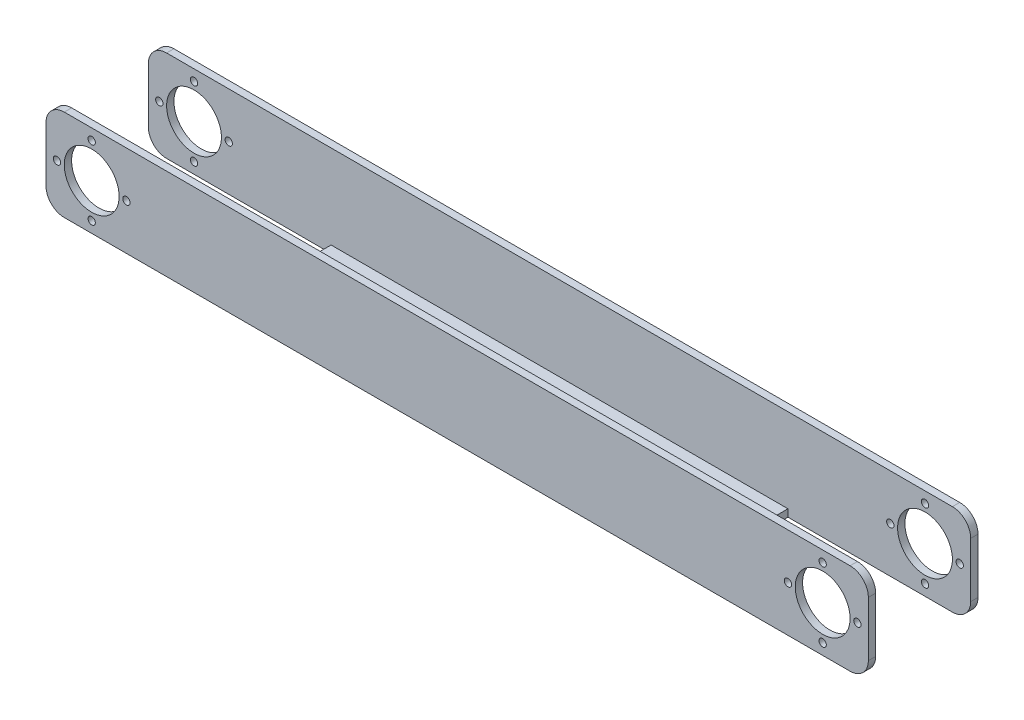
ISO-10303-21;
HEADER;
FILE_DESCRIPTION(('STEP AP214'),'2;1');
FILE_NAME('part.step','',(''),(''),'','','');
FILE_SCHEMA(('AUTOMOTIVE_DESIGN { 1 0 10303 214 1 1 1 1 }'));
ENDSEC;
DATA;
#1=APPLICATION_CONTEXT('core data for automotive mechanical design processes');
#2=APPLICATION_PROTOCOL_DEFINITION('international standard','automotive_design',2000,#1);
#3=PRODUCT_CONTEXT('',#1,'mechanical');
#4=PRODUCT('Part','Part','',(#3));
#5=PRODUCT_RELATED_PRODUCT_CATEGORY('part','',(#4));
#6=PRODUCT_DEFINITION_FORMATION('','',#4);
#7=PRODUCT_DEFINITION_CONTEXT('part definition',#1,'design');
#8=PRODUCT_DEFINITION('design','',#6,#7);
#9=PRODUCT_DEFINITION_SHAPE('','',#8);
#10=(LENGTH_UNIT() NAMED_UNIT(*) SI_UNIT(.MILLI.,.METRE.));
#11=(NAMED_UNIT(*) PLANE_ANGLE_UNIT() SI_UNIT($,.RADIAN.));
#12=(NAMED_UNIT(*) SI_UNIT($,.STERADIAN.) SOLID_ANGLE_UNIT());
#13=UNCERTAINTY_MEASURE_WITH_UNIT(LENGTH_MEASURE(1.E-05),#10,'distance_accuracy_value','');
#14=(GEOMETRIC_REPRESENTATION_CONTEXT(3) GLOBAL_UNCERTAINTY_ASSIGNED_CONTEXT((#13)) GLOBAL_UNIT_ASSIGNED_CONTEXT((#10,
#11,#12)) REPRESENTATION_CONTEXT('',''));
#15=CARTESIAN_POINT('',(0.,0.,0.));
#16=DIRECTION('',(0.,0.,1.));
#17=DIRECTION('',(1.,0.,0.));
#18=AXIS2_PLACEMENT_3D('',#15,#16,#17);
#19=CARTESIAN_POINT('',(112.5,12.5,30.));
#20=DIRECTION('',(-1.,0.,0.));
#21=DIRECTION('',(0.,0.,1.));
#22=AXIS2_PLACEMENT_3D('',#19,#20,#21);
#23=PLANE('',#22);
#24=DIRECTION('',(0.,1.,0.));
#25=VECTOR('',#24,1.);
#26=CARTESIAN_POINT('',(112.5,12.5,30.));
#27=LINE('',#26,#25);
#28=CARTESIAN_POINT('',(112.5,-7.5,30.));
#29=VERTEX_POINT('',#28);
#30=CARTESIAN_POINT('',(112.5,7.5,30.));
#31=VERTEX_POINT('',#30);
#32=EDGE_CURVE('E275',#29,#31,#27,.T.);
#33=ORIENTED_EDGE('',*,*,#32,.F.);
#34=DIRECTION('',(0.,0.,-1.));
#35=VECTOR('',#34,1.);
#36=CARTESIAN_POINT('',(112.5,-7.5,30.));
#37=LINE('',#36,#35);
#38=CARTESIAN_POINT('',(112.5,-7.5,28.));
#39=VERTEX_POINT('',#38);
#40=EDGE_CURVE('E11',#29,#39,#37,.T.);
#41=ORIENTED_EDGE('',*,*,#40,.T.);
#42=DIRECTION('',(0.,1.,0.));
#43=VECTOR('',#42,1.);
#44=CARTESIAN_POINT('',(112.5,12.5,28.));
#45=LINE('',#44,#43);
#46=CARTESIAN_POINT('',(112.5,7.5,28.));
#47=VERTEX_POINT('',#46);
#48=EDGE_CURVE('E249',#39,#47,#45,.T.);
#49=ORIENTED_EDGE('',*,*,#48,.T.);
#50=DIRECTION('',(0.,0.,-1.));
#51=VECTOR('',#50,1.);
#52=CARTESIAN_POINT('',(112.5,7.5,30.));
#53=LINE('',#52,#51);
#54=EDGE_CURVE('E52',#47,#31,#53,.F.);
#55=ORIENTED_EDGE('',*,*,#54,.T.);
#56=EDGE_LOOP('',(#33,#41,#49,#55));
#57=FACE_BOUND('',#56,.T.);
#58=ADVANCED_FACE('F43',(#57),#23,.F.);
#59=CARTESIAN_POINT('',(-112.5,-12.5,30.));
#60=DIRECTION('',(1.,0.,0.));
#61=DIRECTION('',(0.,0.,-1.));
#62=AXIS2_PLACEMENT_3D('',#59,#60,#61);
#63=PLANE('',#62);
#64=DIRECTION('',(0.,-1.,0.));
#65=VECTOR('',#64,1.);
#66=CARTESIAN_POINT('',(-112.5,-12.5,0.));
#67=LINE('',#66,#65);
#68=CARTESIAN_POINT('',(-112.5,7.5,0.));
#69=VERTEX_POINT('',#68);
#70=CARTESIAN_POINT('',(-112.5,-7.5,0.));
#71=VERTEX_POINT('',#70);
#72=EDGE_CURVE('E298',#69,#71,#67,.T.);
#73=ORIENTED_EDGE('',*,*,#72,.T.);
#74=DIRECTION('',(0.,0.,-1.));
#75=VECTOR('',#74,1.);
#76=CARTESIAN_POINT('',(-112.5,-7.5,30.));
#77=LINE('',#76,#75);
#78=CARTESIAN_POINT('',(-112.5,-7.5,2.));
#79=VERTEX_POINT('',#78);
#80=EDGE_CURVE('E382',#71,#79,#77,.F.);
#81=ORIENTED_EDGE('',*,*,#80,.T.);
#82=DIRECTION('',(0.,-1.,0.));
#83=VECTOR('',#82,1.);
#84=CARTESIAN_POINT('',(-112.5,-12.5,2.));
#85=LINE('',#84,#83);
#86=CARTESIAN_POINT('',(-112.5,7.5,2.));
#87=VERTEX_POINT('',#86);
#88=EDGE_CURVE('E250',#87,#79,#85,.T.);
#89=ORIENTED_EDGE('',*,*,#88,.F.);
#90=DIRECTION('',(0.,0.,-1.));
#91=VECTOR('',#90,1.);
#92=CARTESIAN_POINT('',(-112.5,7.5,30.));
#93=LINE('',#92,#91);
#94=EDGE_CURVE('E378',#87,#69,#93,.T.);
#95=ORIENTED_EDGE('',*,*,#94,.T.);
#96=EDGE_LOOP('',(#73,#81,#89,#95));
#97=FACE_BOUND('',#96,.T.);
#98=ADVANCED_FACE('F510',(#97),#63,.F.);
#99=DIRECTION('',(0.,1.,0.));
#100=VECTOR('',#99,1.);
#101=CARTESIAN_POINT('',(112.5,12.5,2.));
#102=LINE('',#101,#100);
#103=CARTESIAN_POINT('',(112.5,-7.5,2.));
#104=VERTEX_POINT('',#103);
#105=CARTESIAN_POINT('',(112.5,7.5,2.));
#106=VERTEX_POINT('',#105);
#107=EDGE_CURVE('E245',#104,#106,#102,.T.);
#108=ORIENTED_EDGE('',*,*,#107,.F.);
#109=DIRECTION('',(0.,0.,-1.));
#110=VECTOR('',#109,1.);
#111=CARTESIAN_POINT('',(112.5,-7.5,30.));
#112=LINE('',#111,#110);
#113=CARTESIAN_POINT('',(112.5,-7.5,0.));
#114=VERTEX_POINT('',#113);
#115=EDGE_CURVE('E442',#104,#114,#112,.T.);
#116=ORIENTED_EDGE('',*,*,#115,.T.);
#117=DIRECTION('',(0.,1.,0.));
#118=VECTOR('',#117,1.);
#119=CARTESIAN_POINT('',(112.5,12.5,0.));
#120=LINE('',#119,#118);
#121=CARTESIAN_POINT('',(112.5,7.5,0.));
#122=VERTEX_POINT('',#121);
#123=EDGE_CURVE('E255',#114,#122,#120,.T.);
#124=ORIENTED_EDGE('',*,*,#123,.T.);
#125=DIRECTION('',(0.,0.,-1.));
#126=VECTOR('',#125,1.);
#127=CARTESIAN_POINT('',(112.5,7.5,30.));
#128=LINE('',#127,#126);
#129=EDGE_CURVE('E439',#122,#106,#128,.F.);
#130=ORIENTED_EDGE('',*,*,#129,.T.);
#131=EDGE_LOOP('',(#108,#116,#124,#130));
#132=FACE_BOUND('',#131,.T.);
#133=ADVANCED_FACE('F493',(#132),#23,.F.);
#134=CARTESIAN_POINT('',(-112.5,12.5,30.));
#135=DIRECTION('',(0.,-1.,0.));
#136=DIRECTION('',(0.,0.,-1.));
#137=AXIS2_PLACEMENT_3D('',#134,#135,#136);
#138=PLANE('',#137);
#139=DIRECTION('',(-1.,0.,0.));
#140=VECTOR('',#139,1.);
#141=CARTESIAN_POINT('',(-112.5,12.5,0.));
#142=LINE('',#141,#140);
#143=CARTESIAN_POINT('',(107.5,12.5,0.));
#144=VERTEX_POINT('',#143);
#145=CARTESIAN_POINT('',(-107.5,12.5,0.));
#146=VERTEX_POINT('',#145);
#147=EDGE_CURVE('E294',#144,#146,#142,.T.);
#148=ORIENTED_EDGE('',*,*,#147,.T.);
#149=DIRECTION('',(0.,0.,-1.));
#150=VECTOR('',#149,1.);
#151=CARTESIAN_POINT('',(-107.5,12.5,30.));
#152=LINE('',#151,#150);
#153=CARTESIAN_POINT('',(-107.5,12.5,2.));
#154=VERTEX_POINT('',#153);
#155=EDGE_CURVE('E400',#146,#154,#152,.F.);
#156=ORIENTED_EDGE('',*,*,#155,.T.);
#157=DIRECTION('',(-1.,0.,0.));
#158=VECTOR('',#157,1.);
#159=CARTESIAN_POINT('',(-112.5,12.5,2.));
#160=LINE('',#159,#158);
#161=CARTESIAN_POINT('',(107.5,12.5,2.));
#162=VERTEX_POINT('',#161);
#163=EDGE_CURVE('E260',#162,#154,#160,.T.);
#164=ORIENTED_EDGE('',*,*,#163,.F.);
#165=DIRECTION('',(0.,0.,-1.));
#166=VECTOR('',#165,1.);
#167=CARTESIAN_POINT('',(107.5,12.5,30.));
#168=LINE('',#167,#166);
#169=EDGE_CURVE('E396',#162,#144,#168,.T.);
#170=ORIENTED_EDGE('',*,*,#169,.T.);
#171=EDGE_LOOP('',(#148,#156,#164,#170));
#172=FACE_BOUND('',#171,.T.);
#173=ADVANCED_FACE('F502',(#172),#138,.F.);
#174=DIRECTION('',(0.,-1.,0.));
#175=VECTOR('',#174,1.);
#176=CARTESIAN_POINT('',(-112.5,-12.5,28.));
#177=LINE('',#176,#175);
#178=CARTESIAN_POINT('',(-112.5,7.5,28.));
#179=VERTEX_POINT('',#178);
#180=CARTESIAN_POINT('',(-112.5,-7.5,28.));
#181=VERTEX_POINT('',#180);
#182=EDGE_CURVE('E256',#179,#181,#177,.T.);
#183=ORIENTED_EDGE('',*,*,#182,.T.);
#184=DIRECTION('',(0.,0.,-1.));
#185=VECTOR('',#184,1.);
#186=CARTESIAN_POINT('',(-112.5,-7.5,30.));
#187=LINE('',#186,#185);
#188=CARTESIAN_POINT('',(-112.5,-7.5,30.));
#189=VERTEX_POINT('',#188);
#190=EDGE_CURVE('E419',#181,#189,#187,.F.);
#191=ORIENTED_EDGE('',*,*,#190,.T.);
#192=DIRECTION('',(0.,-1.,0.));
#193=VECTOR('',#192,1.);
#194=CARTESIAN_POINT('',(-112.5,-12.5,30.));
#195=LINE('',#194,#193);
#196=CARTESIAN_POINT('',(-112.5,7.5,30.));
#197=VERTEX_POINT('',#196);
#198=EDGE_CURVE('E282',#197,#189,#195,.T.);
#199=ORIENTED_EDGE('',*,*,#198,.F.);
#200=DIRECTION('',(0.,0.,-1.));
#201=VECTOR('',#200,1.);
#202=CARTESIAN_POINT('',(-112.5,7.5,30.));
#203=LINE('',#202,#201);
#204=EDGE_CURVE('E415',#197,#179,#203,.T.);
#205=ORIENTED_EDGE('',*,*,#204,.T.);
#206=EDGE_LOOP('',(#183,#191,#199,#205));
#207=FACE_BOUND('',#206,.T.);
#208=ADVANCED_FACE('F467',(#207),#63,.F.);
#209=DIRECTION('',(-1.,0.,0.));
#210=VECTOR('',#209,1.);
#211=CARTESIAN_POINT('',(-112.5,12.5,28.));
#212=LINE('',#211,#210);
#213=CARTESIAN_POINT('',(107.5,12.5,28.));
#214=VERTEX_POINT('',#213);
#215=CARTESIAN_POINT('',(-107.5,12.5,28.));
#216=VERTEX_POINT('',#215);
#217=EDGE_CURVE('E269',#214,#216,#212,.T.);
#218=ORIENTED_EDGE('',*,*,#217,.T.);
#219=DIRECTION('',(0.,0.,-1.));
#220=VECTOR('',#219,1.);
#221=CARTESIAN_POINT('',(-107.5,12.5,30.));
#222=LINE('',#221,#220);
#223=CARTESIAN_POINT('',(-107.5,12.5,30.));
#224=VERTEX_POINT('',#223);
#225=EDGE_CURVE('E59',#216,#224,#222,.F.);
#226=ORIENTED_EDGE('',*,*,#225,.T.);
#227=DIRECTION('',(-1.,0.,0.));
#228=VECTOR('',#227,1.);
#229=CARTESIAN_POINT('',(-112.5,12.5,30.));
#230=LINE('',#229,#228);
#231=CARTESIAN_POINT('',(107.5,12.5,30.));
#232=VERTEX_POINT('',#231);
#233=EDGE_CURVE('E278',#232,#224,#230,.T.);
#234=ORIENTED_EDGE('',*,*,#233,.F.);
#235=DIRECTION('',(0.,0.,-1.));
#236=VECTOR('',#235,1.);
#237=CARTESIAN_POINT('',(107.5,12.5,30.));
#238=LINE('',#237,#236);
#239=EDGE_CURVE('E433',#232,#214,#238,.T.);
#240=ORIENTED_EDGE('',*,*,#239,.T.);
#241=EDGE_LOOP('',(#218,#226,#234,#240));
#242=FACE_BOUND('',#241,.T.);
#243=ADVANCED_FACE('F457',(#242),#138,.F.);
#244=CARTESIAN_POINT('',(-112.5,-12.5,30.));
#245=DIRECTION('',(0.,1.,0.));
#246=DIRECTION('',(0.,0.,1.));
#247=AXIS2_PLACEMENT_3D('',#244,#245,#246);
#248=PLANE('',#247);
#249=DIRECTION('',(1.,0.,0.));
#250=VECTOR('',#249,1.);
#251=CARTESIAN_POINT('',(-112.5,-12.5,2.));
#252=LINE('',#251,#250);
#253=CARTESIAN_POINT('',(-107.5,-12.5,2.));
#254=VERTEX_POINT('',#253);
#255=CARTESIAN_POINT('',(-62.5,-12.5,2.));
#256=VERTEX_POINT('',#255);
#257=EDGE_CURVE('E183',#254,#256,#252,.T.);
#258=ORIENTED_EDGE('',*,*,#257,.F.);
#259=DIRECTION('',(0.,0.,-1.));
#260=VECTOR('',#259,1.);
#261=CARTESIAN_POINT('',(-107.5,-12.5,30.));
#262=LINE('',#261,#260);
#263=CARTESIAN_POINT('',(-107.5,-12.5,0.));
#264=VERTEX_POINT('',#263);
#265=EDGE_CURVE('E363',#254,#264,#262,.T.);
#266=ORIENTED_EDGE('',*,*,#265,.T.);
#267=DIRECTION('',(1.,0.,0.));
#268=VECTOR('',#267,1.);
#269=CARTESIAN_POINT('',(-112.5,-12.5,0.));
#270=LINE('',#269,#268);
#271=CARTESIAN_POINT('',(107.5,-12.5,0.));
#272=VERTEX_POINT('',#271);
#273=EDGE_CURVE('E279',#264,#272,#270,.T.);
#274=ORIENTED_EDGE('',*,*,#273,.T.);
#275=DIRECTION('',(0.,0.,-1.));
#276=VECTOR('',#275,1.);
#277=CARTESIAN_POINT('',(107.5,-12.5,30.));
#278=LINE('',#277,#276);
#279=CARTESIAN_POINT('',(107.5,-12.5,2.));
#280=VERTEX_POINT('',#279);
#281=EDGE_CURVE('E357',#272,#280,#278,.F.);
#282=ORIENTED_EDGE('',*,*,#281,.T.);
#283=DIRECTION('',(1.,0.,0.));
#284=VECTOR('',#283,1.);
#285=CARTESIAN_POINT('',(112.5,-12.5,2.));
#286=LINE('',#285,#284);
#287=CARTESIAN_POINT('',(62.5,-12.5,1.99999999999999));
#288=VERTEX_POINT('',#287);
#289=EDGE_CURVE('E231',#288,#280,#286,.T.);
#290=ORIENTED_EDGE('',*,*,#289,.F.);
#291=DIRECTION('',(0.,0.,-1.));
#292=VECTOR('',#291,1.);
#293=CARTESIAN_POINT('',(62.5,-12.5,28.));
#294=LINE('',#293,#292);
#295=CARTESIAN_POINT('',(62.5,-12.5,28.));
#296=VERTEX_POINT('',#295);
#297=EDGE_CURVE('E226',#296,#288,#294,.T.);
#298=ORIENTED_EDGE('',*,*,#297,.F.);
#299=DIRECTION('',(-1.,0.,0.));
#300=VECTOR('',#299,1.);
#301=CARTESIAN_POINT('',(112.5,-12.5,28.));
#302=LINE('',#301,#300);
#303=CARTESIAN_POINT('',(107.5,-12.5,28.));
#304=VERTEX_POINT('',#303);
#305=EDGE_CURVE('E223',#304,#296,#302,.T.);
#306=ORIENTED_EDGE('',*,*,#305,.F.);
#307=DIRECTION('',(0.,0.,-1.));
#308=VECTOR('',#307,1.);
#309=CARTESIAN_POINT('',(107.5,-12.5,30.));
#310=LINE('',#309,#308);
#311=CARTESIAN_POINT('',(107.5,-12.5,30.));
#312=VERTEX_POINT('',#311);
#313=EDGE_CURVE('E290',#304,#312,#310,.F.);
#314=ORIENTED_EDGE('',*,*,#313,.T.);
#315=DIRECTION('',(1.,0.,0.));
#316=VECTOR('',#315,1.);
#317=CARTESIAN_POINT('',(-112.5,-12.5,30.));
#318=LINE('',#317,#316);
#319=CARTESIAN_POINT('',(-107.5,-12.5,30.));
#320=VERTEX_POINT('',#319);
#321=EDGE_CURVE('E286',#320,#312,#318,.T.);
#322=ORIENTED_EDGE('',*,*,#321,.F.);
#323=DIRECTION('',(0.,0.,-1.));
#324=VECTOR('',#323,1.);
#325=CARTESIAN_POINT('',(-107.5,-12.5,30.));
#326=LINE('',#325,#324);
#327=CARTESIAN_POINT('',(-107.5,-12.5,28.));
#328=VERTEX_POINT('',#327);
#329=EDGE_CURVE('E360',#320,#328,#326,.T.);
#330=ORIENTED_EDGE('',*,*,#329,.T.);
#331=DIRECTION('',(-1.,0.,0.));
#332=VECTOR('',#331,1.);
#333=CARTESIAN_POINT('',(-112.5,-12.5,28.));
#334=LINE('',#333,#332);
#335=CARTESIAN_POINT('',(-62.5,-12.5,28.));
#336=VERTEX_POINT('',#335);
#337=EDGE_CURVE('E208',#336,#328,#334,.T.);
#338=ORIENTED_EDGE('',*,*,#337,.F.);
#339=DIRECTION('',(0.,0.,1.));
#340=VECTOR('',#339,1.);
#341=CARTESIAN_POINT('',(-62.5,-12.5,2.));
#342=LINE('',#341,#340);
#343=EDGE_CURVE('E197',#256,#336,#342,.T.);
#344=ORIENTED_EDGE('',*,*,#343,.F.);
#345=EDGE_LOOP('',(#258,#266,#274,#282,#290,#298,#306,#314,#322,#330,#338,#344));
#346=FACE_BOUND('',#345,.T.);
#347=ADVANCED_FACE('F210',(#346),#248,.F.);
#348=CARTESIAN_POINT('',(0.,0.,30.));
#349=DIRECTION('',(0.,0.,1.));
#350=DIRECTION('',(1.,0.,0.));
#351=AXIS2_PLACEMENT_3D('',#348,#349,#350);
#352=PLANE('',#351);
#353=CARTESIAN_POINT('',(100.,-9.5,30.));
#354=DIRECTION('',(0.,0.,1.));
#355=DIRECTION('',(1.,0.,0.));
#356=AXIS2_PLACEMENT_3D('',#353,#354,#355);
#357=CIRCLE('',#356,0.999999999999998);
#358=CARTESIAN_POINT('',(101.,-9.5,30.));
#359=VERTEX_POINT('',#358);
#360=EDGE_CURVE('E1070',#359,#359,#357,.T.);
#361=ORIENTED_EDGE('',*,*,#360,.F.);
#362=EDGE_LOOP('',(#361));
#363=FACE_BOUND('',#362,.T.);
#364=CARTESIAN_POINT('',(109.5,0.,30.));
#365=DIRECTION('',(0.,0.,1.));
#366=DIRECTION('',(1.,0.,0.));
#367=AXIS2_PLACEMENT_3D('',#364,#365,#366);
#368=CIRCLE('',#367,0.999999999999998);
#369=CARTESIAN_POINT('',(110.5,0.,30.));
#370=VERTEX_POINT('',#369);
#371=EDGE_CURVE('E1165',#370,#370,#368,.T.);
#372=ORIENTED_EDGE('',*,*,#371,.F.);
#373=EDGE_LOOP('',(#372));
#374=FACE_BOUND('',#373,.T.);
#375=CARTESIAN_POINT('',(100.,9.5,30.));
#376=DIRECTION('',(0.,0.,1.));
#377=DIRECTION('',(1.,0.,0.));
#378=AXIS2_PLACEMENT_3D('',#375,#376,#377);
#379=CIRCLE('',#378,0.999999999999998);
#380=CARTESIAN_POINT('',(101.,9.5,30.));
#381=VERTEX_POINT('',#380);
#382=EDGE_CURVE('E1145',#381,#381,#379,.T.);
#383=ORIENTED_EDGE('',*,*,#382,.F.);
#384=EDGE_LOOP('',(#383));
#385=FACE_BOUND('',#384,.T.);
#386=CARTESIAN_POINT('',(100.,0.,30.));
#387=DIRECTION('',(0.,0.,1.));
#388=DIRECTION('',(1.,0.,0.));
#389=AXIS2_PLACEMENT_3D('',#386,#387,#388);
#390=CIRCLE('',#389,7.50000000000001);
#391=CARTESIAN_POINT('',(107.5,0.,30.));
#392=VERTEX_POINT('',#391);
#393=EDGE_CURVE('E1154',#392,#392,#390,.T.);
#394=ORIENTED_EDGE('',*,*,#393,.F.);
#395=EDGE_LOOP('',(#394));
#396=FACE_BOUND('',#395,.T.);
#397=CARTESIAN_POINT('',(90.5,0.,30.));
#398=DIRECTION('',(0.,0.,1.));
#399=DIRECTION('',(1.,0.,0.));
#400=AXIS2_PLACEMENT_3D('',#397,#398,#399);
#401=CIRCLE('',#400,0.999999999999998);
#402=CARTESIAN_POINT('',(91.5,0.,30.));
#403=VERTEX_POINT('',#402);
#404=EDGE_CURVE('E1137',#403,#403,#401,.T.);
#405=ORIENTED_EDGE('',*,*,#404,.F.);
#406=EDGE_LOOP('',(#405));
#407=FACE_BOUND('',#406,.T.);
#408=CARTESIAN_POINT('',(-90.5,0.,30.));
#409=DIRECTION('',(0.,0.,1.));
#410=DIRECTION('',(-1.,0.,0.));
#411=AXIS2_PLACEMENT_3D('',#408,#409,#410);
#412=CIRCLE('',#411,0.999999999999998);
#413=CARTESIAN_POINT('',(-91.5,0.,30.));
#414=VERTEX_POINT('',#413);
#415=EDGE_CURVE('E1129',#414,#414,#412,.T.);
#416=ORIENTED_EDGE('',*,*,#415,.F.);
#417=EDGE_LOOP('',(#416));
#418=FACE_BOUND('',#417,.T.);
#419=CARTESIAN_POINT('',(-100.,-9.50000000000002,30.));
#420=DIRECTION('',(0.,0.,1.));
#421=DIRECTION('',(-1.,0.,0.));
#422=AXIS2_PLACEMENT_3D('',#419,#420,#421);
#423=CIRCLE('',#422,0.999999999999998);
#424=CARTESIAN_POINT('',(-101.,-9.50000000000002,30.));
#425=VERTEX_POINT('',#424);
#426=EDGE_CURVE('E1121',#425,#425,#423,.T.);
#427=ORIENTED_EDGE('',*,*,#426,.F.);
#428=EDGE_LOOP('',(#427));
#429=FACE_BOUND('',#428,.T.);
#430=CARTESIAN_POINT('',(-109.5,0.,30.));
#431=DIRECTION('',(0.,0.,1.));
#432=DIRECTION('',(-1.,0.,0.));
#433=AXIS2_PLACEMENT_3D('',#430,#431,#432);
#434=CIRCLE('',#433,0.999999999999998);
#435=CARTESIAN_POINT('',(-110.5,0.,30.));
#436=VERTEX_POINT('',#435);
#437=EDGE_CURVE('E1112',#436,#436,#434,.T.);
#438=ORIENTED_EDGE('',*,*,#437,.F.);
#439=EDGE_LOOP('',(#438));
#440=FACE_BOUND('',#439,.T.);
#441=CARTESIAN_POINT('',(-100.,9.49999999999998,30.));
#442=DIRECTION('',(0.,0.,1.));
#443=DIRECTION('',(-1.,0.,0.));
#444=AXIS2_PLACEMENT_3D('',#441,#442,#443);
#445=CIRCLE('',#444,0.999999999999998);
#446=CARTESIAN_POINT('',(-101.,9.49999999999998,30.));
#447=VERTEX_POINT('',#446);
#448=EDGE_CURVE('E1172',#447,#447,#445,.T.);
#449=ORIENTED_EDGE('',*,*,#448,.F.);
#450=EDGE_LOOP('',(#449));
#451=FACE_BOUND('',#450,.T.);
#452=CARTESIAN_POINT('',(-100.,0.,30.));
#453=DIRECTION('',(0.,0.,1.));
#454=DIRECTION('',(1.,0.,0.));
#455=AXIS2_PLACEMENT_3D('',#452,#453,#454);
#456=CIRCLE('',#455,7.50000000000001);
#457=CARTESIAN_POINT('',(-92.5,0.,30.));
#458=VERTEX_POINT('',#457);
#459=EDGE_CURVE('E1104',#458,#458,#456,.T.);
#460=ORIENTED_EDGE('',*,*,#459,.F.);
#461=EDGE_LOOP('',(#460));
#462=FACE_BOUND('',#461,.T.);
#463=ORIENTED_EDGE('',*,*,#198,.T.);
#464=CARTESIAN_POINT('',(-107.5,-7.5,30.));
#465=DIRECTION('',(0.,0.,1.));
#466=DIRECTION('',(1.,0.,0.));
#467=AXIS2_PLACEMENT_3D('',#464,#465,#466);
#468=CIRCLE('',#467,5.);
#469=EDGE_CURVE('E430',#189,#320,#468,.T.);
#470=ORIENTED_EDGE('',*,*,#469,.T.);
#471=ORIENTED_EDGE('',*,*,#321,.T.);
#472=CARTESIAN_POINT('',(107.5,-7.5,30.));
#473=DIRECTION('',(0.,0.,1.));
#474=DIRECTION('',(1.,0.,0.));
#475=AXIS2_PLACEMENT_3D('',#472,#473,#474);
#476=CIRCLE('',#475,5.);
#477=EDGE_CURVE('E424',#312,#29,#476,.T.);
#478=ORIENTED_EDGE('',*,*,#477,.T.);
#479=ORIENTED_EDGE('',*,*,#32,.T.);
#480=CARTESIAN_POINT('',(107.5,7.5,30.));
#481=DIRECTION('',(0.,0.,1.));
#482=DIRECTION('',(1.,0.,0.));
#483=AXIS2_PLACEMENT_3D('',#480,#481,#482);
#484=CIRCLE('',#483,5.);
#485=EDGE_CURVE('E66',#31,#232,#484,.T.);
#486=ORIENTED_EDGE('',*,*,#485,.T.);
#487=ORIENTED_EDGE('',*,*,#233,.T.);
#488=CARTESIAN_POINT('',(-107.5,7.5,30.));
#489=DIRECTION('',(0.,0.,1.));
#490=DIRECTION('',(1.,0.,0.));
#491=AXIS2_PLACEMENT_3D('',#488,#489,#490);
#492=CIRCLE('',#491,5.);
#493=EDGE_CURVE('E427',#224,#197,#492,.T.);
#494=ORIENTED_EDGE('',*,*,#493,.T.);
#495=EDGE_LOOP('',(#463,#470,#471,#478,#479,#486,#487,#494));
#496=FACE_BOUND('',#495,.T.);
#497=ADVANCED_FACE('F453',(#363,#374,#385,#396,#407,#418,#429,#440,#451,#462,#496),#352,.T.);
#498=CARTESIAN_POINT('',(0.,0.,0.));
#499=DIRECTION('',(0.,0.,1.));
#500=DIRECTION('',(1.,0.,0.));
#501=AXIS2_PLACEMENT_3D('',#498,#499,#500);
#502=PLANE('',#501);
#503=CARTESIAN_POINT('',(100.,-9.5,0.));
#504=DIRECTION('',(0.,0.,1.));
#505=DIRECTION('',(1.,0.,0.));
#506=AXIS2_PLACEMENT_3D('',#503,#504,#505);
#507=CIRCLE('',#506,0.999999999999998);
#508=CARTESIAN_POINT('',(101.,-9.5,0.));
#509=VERTEX_POINT('',#508);
#510=EDGE_CURVE('E1162',#509,#509,#507,.T.);
#511=ORIENTED_EDGE('',*,*,#510,.T.);
#512=EDGE_LOOP('',(#511));
#513=FACE_BOUND('',#512,.T.);
#514=CARTESIAN_POINT('',(109.5,0.,0.));
#515=DIRECTION('',(0.,0.,1.));
#516=DIRECTION('',(1.,0.,0.));
#517=AXIS2_PLACEMENT_3D('',#514,#515,#516);
#518=CIRCLE('',#517,0.999999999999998);
#519=CARTESIAN_POINT('',(110.5,0.,0.));
#520=VERTEX_POINT('',#519);
#521=EDGE_CURVE('E1150',#520,#520,#518,.T.);
#522=ORIENTED_EDGE('',*,*,#521,.T.);
#523=EDGE_LOOP('',(#522));
#524=FACE_BOUND('',#523,.T.);
#525=CARTESIAN_POINT('',(100.,9.5,0.));
#526=DIRECTION('',(0.,0.,1.));
#527=DIRECTION('',(1.,0.,0.));
#528=AXIS2_PLACEMENT_3D('',#525,#526,#527);
#529=CIRCLE('',#528,0.999999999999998);
#530=CARTESIAN_POINT('',(101.,9.5,0.));
#531=VERTEX_POINT('',#530);
#532=EDGE_CURVE('E1149',#531,#531,#529,.T.);
#533=ORIENTED_EDGE('',*,*,#532,.T.);
#534=EDGE_LOOP('',(#533));
#535=FACE_BOUND('',#534,.T.);
#536=CARTESIAN_POINT('',(100.,0.,0.));
#537=DIRECTION('',(0.,0.,1.));
#538=DIRECTION('',(1.,0.,0.));
#539=AXIS2_PLACEMENT_3D('',#536,#537,#538);
#540=CIRCLE('',#539,7.50000000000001);
#541=CARTESIAN_POINT('',(107.5,0.,0.));
#542=VERTEX_POINT('',#541);
#543=EDGE_CURVE('E1108',#542,#542,#540,.T.);
#544=ORIENTED_EDGE('',*,*,#543,.T.);
#545=EDGE_LOOP('',(#544));
#546=FACE_BOUND('',#545,.T.);
#547=CARTESIAN_POINT('',(90.5,0.,0.));
#548=DIRECTION('',(0.,0.,1.));
#549=DIRECTION('',(1.,0.,0.));
#550=AXIS2_PLACEMENT_3D('',#547,#548,#549);
#551=CIRCLE('',#550,0.999999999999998);
#552=CARTESIAN_POINT('',(91.5,0.,0.));
#553=VERTEX_POINT('',#552);
#554=EDGE_CURVE('E1141',#553,#553,#551,.T.);
#555=ORIENTED_EDGE('',*,*,#554,.T.);
#556=EDGE_LOOP('',(#555));
#557=FACE_BOUND('',#556,.T.);
#558=CARTESIAN_POINT('',(-90.5,0.,0.));
#559=DIRECTION('',(0.,0.,1.));
#560=DIRECTION('',(-1.,0.,0.));
#561=AXIS2_PLACEMENT_3D('',#558,#559,#560);
#562=CIRCLE('',#561,0.999999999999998);
#563=CARTESIAN_POINT('',(-91.5,0.,0.));
#564=VERTEX_POINT('',#563);
#565=EDGE_CURVE('E1133',#564,#564,#562,.T.);
#566=ORIENTED_EDGE('',*,*,#565,.T.);
#567=EDGE_LOOP('',(#566));
#568=FACE_BOUND('',#567,.T.);
#569=CARTESIAN_POINT('',(-100.,-9.50000000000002,0.));
#570=DIRECTION('',(0.,0.,1.));
#571=DIRECTION('',(-1.,0.,0.));
#572=AXIS2_PLACEMENT_3D('',#569,#570,#571);
#573=CIRCLE('',#572,0.999999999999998);
#574=CARTESIAN_POINT('',(-101.,-9.50000000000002,0.));
#575=VERTEX_POINT('',#574);
#576=EDGE_CURVE('E1125',#575,#575,#573,.T.);
#577=ORIENTED_EDGE('',*,*,#576,.T.);
#578=EDGE_LOOP('',(#577));
#579=FACE_BOUND('',#578,.T.);
#580=CARTESIAN_POINT('',(-109.5,0.,0.));
#581=DIRECTION('',(0.,0.,1.));
#582=DIRECTION('',(-1.,0.,0.));
#583=AXIS2_PLACEMENT_3D('',#580,#581,#582);
#584=CIRCLE('',#583,0.999999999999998);
#585=CARTESIAN_POINT('',(-110.5,0.,0.));
#586=VERTEX_POINT('',#585);
#587=EDGE_CURVE('E1116',#586,#586,#584,.T.);
#588=ORIENTED_EDGE('',*,*,#587,.T.);
#589=EDGE_LOOP('',(#588));
#590=FACE_BOUND('',#589,.T.);
#591=CARTESIAN_POINT('',(-100.,9.49999999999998,0.));
#592=DIRECTION('',(0.,0.,1.));
#593=DIRECTION('',(-1.,0.,0.));
#594=AXIS2_PLACEMENT_3D('',#591,#592,#593);
#595=CIRCLE('',#594,0.999999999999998);
#596=CARTESIAN_POINT('',(-101.,9.49999999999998,0.));
#597=VERTEX_POINT('',#596);
#598=EDGE_CURVE('E1117',#597,#597,#595,.T.);
#599=ORIENTED_EDGE('',*,*,#598,.T.);
#600=EDGE_LOOP('',(#599));
#601=FACE_BOUND('',#600,.T.);
#602=CARTESIAN_POINT('',(-100.,0.,0.));
#603=DIRECTION('',(0.,0.,1.));
#604=DIRECTION('',(1.,0.,0.));
#605=AXIS2_PLACEMENT_3D('',#602,#603,#604);
#606=CIRCLE('',#605,7.50000000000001);
#607=CARTESIAN_POINT('',(-92.5,0.,0.));
#608=VERTEX_POINT('',#607);
#609=EDGE_CURVE('E310',#608,#608,#606,.T.);
#610=ORIENTED_EDGE('',*,*,#609,.T.);
#611=EDGE_LOOP('',(#610));
#612=FACE_BOUND('',#611,.T.);
#613=ORIENTED_EDGE('',*,*,#273,.F.);
#614=CARTESIAN_POINT('',(-107.5,-7.5,0.));
#615=DIRECTION('',(0.,0.,1.));
#616=DIRECTION('',(1.,0.,0.));
#617=AXIS2_PLACEMENT_3D('',#614,#615,#616);
#618=CIRCLE('',#617,5.);
#619=EDGE_CURVE('E375',#264,#71,#618,.F.);
#620=ORIENTED_EDGE('',*,*,#619,.T.);
#621=ORIENTED_EDGE('',*,*,#72,.F.);
#622=CARTESIAN_POINT('',(-107.5,7.5,0.));
#623=DIRECTION('',(0.,0.,1.));
#624=DIRECTION('',(1.,0.,0.));
#625=AXIS2_PLACEMENT_3D('',#622,#623,#624);
#626=CIRCLE('',#625,5.);
#627=EDGE_CURVE('E372',#69,#146,#626,.F.);
#628=ORIENTED_EDGE('',*,*,#627,.T.);
#629=ORIENTED_EDGE('',*,*,#147,.F.);
#630=CARTESIAN_POINT('',(107.5,7.5,0.));
#631=DIRECTION('',(0.,0.,1.));
#632=DIRECTION('',(1.,0.,0.));
#633=AXIS2_PLACEMENT_3D('',#630,#631,#632);
#634=CIRCLE('',#633,5.);
#635=EDGE_CURVE('E366',#144,#122,#634,.F.);
#636=ORIENTED_EDGE('',*,*,#635,.T.);
#637=ORIENTED_EDGE('',*,*,#123,.F.);
#638=CARTESIAN_POINT('',(107.5,-7.5,0.));
#639=DIRECTION('',(0.,0.,1.));
#640=DIRECTION('',(1.,0.,0.));
#641=AXIS2_PLACEMENT_3D('',#638,#639,#640);
#642=CIRCLE('',#641,5.);
#643=EDGE_CURVE('E369',#114,#272,#642,.F.);
#644=ORIENTED_EDGE('',*,*,#643,.T.);
#645=EDGE_LOOP('',(#613,#620,#621,#628,#629,#636,#637,#644));
#646=FACE_BOUND('',#645,.T.);
#647=ADVANCED_FACE('F516',(#513,#524,#535,#546,#557,#568,#579,#590,#601,#612,#646),#502,.F.);
#648=CARTESIAN_POINT('',(-112.5,-10.5,30.));
#649=DIRECTION('',(0.,1.,0.));
#650=DIRECTION('',(0.,0.,1.));
#651=AXIS2_PLACEMENT_3D('',#648,#649,#650);
#652=PLANE('',#651);
#653=DIRECTION('',(0.,0.,-1.));
#654=VECTOR('',#653,1.);
#655=CARTESIAN_POINT('',(-62.5,-10.5,30.));
#656=LINE('',#655,#654);
#657=CARTESIAN_POINT('',(-62.5,-10.5,28.));
#658=VERTEX_POINT('',#657);
#659=CARTESIAN_POINT('',(-62.5,-10.5,2.));
#660=VERTEX_POINT('',#659);
#661=EDGE_CURVE('E205',#658,#660,#656,.T.);
#662=ORIENTED_EDGE('',*,*,#661,.F.);
#663=DIRECTION('',(1.,0.,0.));
#664=VECTOR('',#663,1.);
#665=CARTESIAN_POINT('',(-112.5,-10.5,28.));
#666=LINE('',#665,#664);
#667=CARTESIAN_POINT('',(62.5,-10.5,28.));
#668=VERTEX_POINT('',#667);
#669=EDGE_CURVE('E251',#658,#668,#666,.T.);
#670=ORIENTED_EDGE('',*,*,#669,.T.);
#671=DIRECTION('',(0.,0.,1.));
#672=VECTOR('',#671,1.);
#673=CARTESIAN_POINT('',(62.5,-10.5,30.));
#674=LINE('',#673,#672);
#675=CARTESIAN_POINT('',(62.5,-10.5,2.));
#676=VERTEX_POINT('',#675);
#677=EDGE_CURVE('E221',#676,#668,#674,.T.);
#678=ORIENTED_EDGE('',*,*,#677,.F.);
#679=DIRECTION('',(1.,0.,0.));
#680=VECTOR('',#679,1.);
#681=CARTESIAN_POINT('',(-112.5,-10.5,2.));
#682=LINE('',#681,#680);
#683=EDGE_CURVE('E246',#660,#676,#682,.T.);
#684=ORIENTED_EDGE('',*,*,#683,.F.);
#685=EDGE_LOOP('',(#662,#670,#678,#684));
#686=FACE_BOUND('',#685,.T.);
#687=ADVANCED_FACE('F477',(#686),#652,.T.);
#688=CARTESIAN_POINT('',(0.,0.,28.));
#689=DIRECTION('',(0.,0.,1.));
#690=DIRECTION('',(1.,0.,0.));
#691=AXIS2_PLACEMENT_3D('',#688,#689,#690);
#692=PLANE('',#691);
#693=CARTESIAN_POINT('',(100.,-9.5,28.));
#694=DIRECTION('',(0.,0.,1.));
#695=DIRECTION('',(1.,0.,0.));
#696=AXIS2_PLACEMENT_3D('',#693,#694,#695);
#697=CIRCLE('',#696,0.999999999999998);
#698=CARTESIAN_POINT('',(101.,-9.5,28.));
#699=VERTEX_POINT('',#698);
#700=EDGE_CURVE('E227',#699,#699,#697,.T.);
#701=ORIENTED_EDGE('',*,*,#700,.T.);
#702=EDGE_LOOP('',(#701));
#703=FACE_BOUND('',#702,.T.);
#704=CARTESIAN_POINT('',(109.5,0.,28.));
#705=DIRECTION('',(0.,0.,1.));
#706=DIRECTION('',(1.,0.,0.));
#707=AXIS2_PLACEMENT_3D('',#704,#705,#706);
#708=CIRCLE('',#707,0.999999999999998);
#709=CARTESIAN_POINT('',(110.5,0.,28.));
#710=VERTEX_POINT('',#709);
#711=EDGE_CURVE('E350',#710,#710,#708,.T.);
#712=ORIENTED_EDGE('',*,*,#711,.T.);
#713=EDGE_LOOP('',(#712));
#714=FACE_BOUND('',#713,.T.);
#715=CARTESIAN_POINT('',(100.,9.5,28.));
#716=DIRECTION('',(0.,0.,1.));
#717=DIRECTION('',(1.,0.,0.));
#718=AXIS2_PLACEMENT_3D('',#715,#716,#717);
#719=CIRCLE('',#718,0.999999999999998);
#720=CARTESIAN_POINT('',(101.,9.5,28.));
#721=VERTEX_POINT('',#720);
#722=EDGE_CURVE('E345',#721,#721,#719,.T.);
#723=ORIENTED_EDGE('',*,*,#722,.T.);
#724=EDGE_LOOP('',(#723));
#725=FACE_BOUND('',#724,.T.);
#726=CARTESIAN_POINT('',(100.,0.,28.));
#727=DIRECTION('',(0.,0.,1.));
#728=DIRECTION('',(1.,0.,0.));
#729=AXIS2_PLACEMENT_3D('',#726,#727,#728);
#730=CIRCLE('',#729,7.50000000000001);
#731=CARTESIAN_POINT('',(107.5,0.,28.));
#732=VERTEX_POINT('',#731);
#733=EDGE_CURVE('E340',#732,#732,#730,.T.);
#734=ORIENTED_EDGE('',*,*,#733,.T.);
#735=EDGE_LOOP('',(#734));
#736=FACE_BOUND('',#735,.T.);
#737=CARTESIAN_POINT('',(90.5,0.,28.));
#738=DIRECTION('',(0.,0.,1.));
#739=DIRECTION('',(1.,0.,0.));
#740=AXIS2_PLACEMENT_3D('',#737,#738,#739);
#741=CIRCLE('',#740,0.999999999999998);
#742=CARTESIAN_POINT('',(91.5,0.,28.));
#743=VERTEX_POINT('',#742);
#744=EDGE_CURVE('E335',#743,#743,#741,.T.);
#745=ORIENTED_EDGE('',*,*,#744,.T.);
#746=EDGE_LOOP('',(#745));
#747=FACE_BOUND('',#746,.T.);
#748=CARTESIAN_POINT('',(-90.5,0.,28.));
#749=DIRECTION('',(0.,0.,1.));
#750=DIRECTION('',(1.,0.,0.));
#751=AXIS2_PLACEMENT_3D('',#748,#749,#750);
#752=CIRCLE('',#751,0.999999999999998);
#753=CARTESIAN_POINT('',(-89.5,0.,28.));
#754=VERTEX_POINT('',#753);
#755=EDGE_CURVE('E330',#754,#754,#752,.T.);
#756=ORIENTED_EDGE('',*,*,#755,.T.);
#757=EDGE_LOOP('',(#756));
#758=FACE_BOUND('',#757,.T.);
#759=CARTESIAN_POINT('',(-100.,-9.50000000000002,28.));
#760=DIRECTION('',(0.,0.,1.));
#761=DIRECTION('',(1.,0.,0.));
#762=AXIS2_PLACEMENT_3D('',#759,#760,#761);
#763=CIRCLE('',#762,0.999999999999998);
#764=CARTESIAN_POINT('',(-99.,-9.50000000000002,28.));
#765=VERTEX_POINT('',#764);
#766=EDGE_CURVE('E325',#765,#765,#763,.T.);
#767=ORIENTED_EDGE('',*,*,#766,.T.);
#768=EDGE_LOOP('',(#767));
#769=FACE_BOUND('',#768,.T.);
#770=CARTESIAN_POINT('',(-109.5,0.,28.));
#771=DIRECTION('',(0.,0.,1.));
#772=DIRECTION('',(1.,0.,0.));
#773=AXIS2_PLACEMENT_3D('',#770,#771,#772);
#774=CIRCLE('',#773,0.999999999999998);
#775=CARTESIAN_POINT('',(-108.5,0.,28.));
#776=VERTEX_POINT('',#775);
#777=EDGE_CURVE('E320',#776,#776,#774,.T.);
#778=ORIENTED_EDGE('',*,*,#777,.T.);
#779=EDGE_LOOP('',(#778));
#780=FACE_BOUND('',#779,.T.);
#781=CARTESIAN_POINT('',(-100.,9.49999999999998,28.));
#782=DIRECTION('',(0.,0.,1.));
#783=DIRECTION('',(1.,0.,0.));
#784=AXIS2_PLACEMENT_3D('',#781,#782,#783);
#785=CIRCLE('',#784,0.999999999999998);
#786=CARTESIAN_POINT('',(-99.,9.49999999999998,28.));
#787=VERTEX_POINT('',#786);
#788=EDGE_CURVE('E315',#787,#787,#785,.T.);
#789=ORIENTED_EDGE('',*,*,#788,.T.);
#790=EDGE_LOOP('',(#789));
#791=FACE_BOUND('',#790,.T.);
#792=CARTESIAN_POINT('',(-100.,0.,28.));
#793=DIRECTION('',(0.,0.,1.));
#794=DIRECTION('',(1.,0.,0.));
#795=AXIS2_PLACEMENT_3D('',#792,#793,#794);
#796=CIRCLE('',#795,7.50000000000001);
#797=CARTESIAN_POINT('',(-92.5,0.,28.));
#798=VERTEX_POINT('',#797);
#799=EDGE_CURVE('E309',#798,#798,#796,.T.);
#800=ORIENTED_EDGE('',*,*,#799,.T.);
#801=EDGE_LOOP('',(#800));
#802=FACE_BOUND('',#801,.T.);
#803=ORIENTED_EDGE('',*,*,#337,.T.);
#804=CARTESIAN_POINT('',(-107.5,-7.5,28.));
#805=DIRECTION('',(0.,0.,1.));
#806=DIRECTION('',(1.,0.,0.));
#807=AXIS2_PLACEMENT_3D('',#804,#805,#806);
#808=CIRCLE('',#807,5.);
#809=EDGE_CURVE('E412',#328,#181,#808,.F.);
#810=ORIENTED_EDGE('',*,*,#809,.T.);
#811=ORIENTED_EDGE('',*,*,#182,.F.);
#812=CARTESIAN_POINT('',(-107.5,7.5,28.));
#813=DIRECTION('',(0.,0.,1.));
#814=DIRECTION('',(1.,0.,0.));
#815=AXIS2_PLACEMENT_3D('',#812,#813,#814);
#816=CIRCLE('',#815,5.);
#817=EDGE_CURVE('E409',#179,#216,#816,.F.);
#818=ORIENTED_EDGE('',*,*,#817,.T.);
#819=ORIENTED_EDGE('',*,*,#217,.F.);
#820=CARTESIAN_POINT('',(107.5,7.5,28.));
#821=DIRECTION('',(0.,0.,1.));
#822=DIRECTION('',(1.,0.,0.));
#823=AXIS2_PLACEMENT_3D('',#820,#821,#822);
#824=CIRCLE('',#823,5.);
#825=EDGE_CURVE('E403',#214,#47,#824,.F.);
#826=ORIENTED_EDGE('',*,*,#825,.T.);
#827=ORIENTED_EDGE('',*,*,#48,.F.);
#828=CARTESIAN_POINT('',(107.5,-7.5,28.));
#829=DIRECTION('',(0.,0.,1.));
#830=DIRECTION('',(1.,0.,0.));
#831=AXIS2_PLACEMENT_3D('',#828,#829,#830);
#832=CIRCLE('',#831,5.);
#833=EDGE_CURVE('E406',#39,#304,#832,.F.);
#834=ORIENTED_EDGE('',*,*,#833,.T.);
#835=ORIENTED_EDGE('',*,*,#305,.T.);
#836=DIRECTION('',(0.,-1.,0.));
#837=VECTOR('',#836,1.);
#838=CARTESIAN_POINT('',(62.5,12.5,28.));
#839=LINE('',#838,#837);
#840=EDGE_CURVE('E235',#668,#296,#839,.T.);
#841=ORIENTED_EDGE('',*,*,#840,.F.);
#842=ORIENTED_EDGE('',*,*,#669,.F.);
#843=DIRECTION('',(0.,-1.,0.));
#844=VECTOR('',#843,1.);
#845=CARTESIAN_POINT('',(-62.5,12.5,28.));
#846=LINE('',#845,#844);
#847=EDGE_CURVE('E207',#658,#336,#846,.T.);
#848=ORIENTED_EDGE('',*,*,#847,.T.);
#849=EDGE_LOOP('',(#803,#810,#811,#818,#819,#826,#827,#834,#835,#841,#842,#848));
#850=FACE_BOUND('',#849,.T.);
#851=ADVANCED_FACE('F459',(#703,#714,#725,#736,#747,#758,#769,#780,#791,#802,#850),#692,.F.);
#852=CARTESIAN_POINT('',(0.,0.,2.));
#853=DIRECTION('',(0.,0.,1.));
#854=DIRECTION('',(1.,0.,0.));
#855=AXIS2_PLACEMENT_3D('',#852,#853,#854);
#856=PLANE('',#855);
#857=CARTESIAN_POINT('',(100.,-9.5,2.));
#858=DIRECTION('',(0.,0.,1.));
#859=DIRECTION('',(1.,0.,0.));
#860=AXIS2_PLACEMENT_3D('',#857,#858,#859);
#861=CIRCLE('',#860,0.999999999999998);
#862=CARTESIAN_POINT('',(101.,-9.5,2.));
#863=VERTEX_POINT('',#862);
#864=EDGE_CURVE('E351',#863,#863,#861,.T.);
#865=ORIENTED_EDGE('',*,*,#864,.F.);
#866=EDGE_LOOP('',(#865));
#867=FACE_BOUND('',#866,.T.);
#868=CARTESIAN_POINT('',(109.5,0.,2.));
#869=DIRECTION('',(0.,0.,1.));
#870=DIRECTION('',(1.,0.,0.));
#871=AXIS2_PLACEMENT_3D('',#868,#869,#870);
#872=CIRCLE('',#871,0.999999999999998);
#873=CARTESIAN_POINT('',(110.5,0.,2.));
#874=VERTEX_POINT('',#873);
#875=EDGE_CURVE('E346',#874,#874,#872,.T.);
#876=ORIENTED_EDGE('',*,*,#875,.F.);
#877=EDGE_LOOP('',(#876));
#878=FACE_BOUND('',#877,.T.);
#879=CARTESIAN_POINT('',(100.,9.5,2.));
#880=DIRECTION('',(0.,0.,1.));
#881=DIRECTION('',(1.,0.,0.));
#882=AXIS2_PLACEMENT_3D('',#879,#880,#881);
#883=CIRCLE('',#882,0.999999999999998);
#884=CARTESIAN_POINT('',(101.,9.5,2.));
#885=VERTEX_POINT('',#884);
#886=EDGE_CURVE('E341',#885,#885,#883,.T.);
#887=ORIENTED_EDGE('',*,*,#886,.F.);
#888=EDGE_LOOP('',(#887));
#889=FACE_BOUND('',#888,.T.);
#890=CARTESIAN_POINT('',(100.,0.,2.));
#891=DIRECTION('',(0.,0.,1.));
#892=DIRECTION('',(1.,0.,0.));
#893=AXIS2_PLACEMENT_3D('',#890,#891,#892);
#894=CIRCLE('',#893,7.50000000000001);
#895=CARTESIAN_POINT('',(107.5,0.,2.));
#896=VERTEX_POINT('',#895);
#897=EDGE_CURVE('E336',#896,#896,#894,.T.);
#898=ORIENTED_EDGE('',*,*,#897,.F.);
#899=EDGE_LOOP('',(#898));
#900=FACE_BOUND('',#899,.T.);
#901=CARTESIAN_POINT('',(90.5,0.,2.));
#902=DIRECTION('',(0.,0.,1.));
#903=DIRECTION('',(1.,0.,0.));
#904=AXIS2_PLACEMENT_3D('',#901,#902,#903);
#905=CIRCLE('',#904,0.999999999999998);
#906=CARTESIAN_POINT('',(91.5,0.,2.));
#907=VERTEX_POINT('',#906);
#908=EDGE_CURVE('E331',#907,#907,#905,.T.);
#909=ORIENTED_EDGE('',*,*,#908,.F.);
#910=EDGE_LOOP('',(#909));
#911=FACE_BOUND('',#910,.T.);
#912=CARTESIAN_POINT('',(-90.5,0.,2.));
#913=DIRECTION('',(0.,0.,1.));
#914=DIRECTION('',(1.,0.,0.));
#915=AXIS2_PLACEMENT_3D('',#912,#913,#914);
#916=CIRCLE('',#915,0.999999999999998);
#917=CARTESIAN_POINT('',(-89.5,0.,2.));
#918=VERTEX_POINT('',#917);
#919=EDGE_CURVE('E326',#918,#918,#916,.T.);
#920=ORIENTED_EDGE('',*,*,#919,.F.);
#921=EDGE_LOOP('',(#920));
#922=FACE_BOUND('',#921,.T.);
#923=CARTESIAN_POINT('',(-100.,-9.50000000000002,2.));
#924=DIRECTION('',(0.,0.,1.));
#925=DIRECTION('',(1.,0.,0.));
#926=AXIS2_PLACEMENT_3D('',#923,#924,#925);
#927=CIRCLE('',#926,0.999999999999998);
#928=CARTESIAN_POINT('',(-99.,-9.50000000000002,2.));
#929=VERTEX_POINT('',#928);
#930=EDGE_CURVE('E321',#929,#929,#927,.T.);
#931=ORIENTED_EDGE('',*,*,#930,.F.);
#932=EDGE_LOOP('',(#931));
#933=FACE_BOUND('',#932,.T.);
#934=CARTESIAN_POINT('',(-109.5,0.,2.));
#935=DIRECTION('',(0.,0.,1.));
#936=DIRECTION('',(1.,0.,0.));
#937=AXIS2_PLACEMENT_3D('',#934,#935,#936);
#938=CIRCLE('',#937,0.999999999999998);
#939=CARTESIAN_POINT('',(-108.5,0.,2.));
#940=VERTEX_POINT('',#939);
#941=EDGE_CURVE('E316',#940,#940,#938,.T.);
#942=ORIENTED_EDGE('',*,*,#941,.F.);
#943=EDGE_LOOP('',(#942));
#944=FACE_BOUND('',#943,.T.);
#945=CARTESIAN_POINT('',(-100.,9.49999999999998,2.));
#946=DIRECTION('',(0.,0.,1.));
#947=DIRECTION('',(1.,0.,0.));
#948=AXIS2_PLACEMENT_3D('',#945,#946,#947);
#949=CIRCLE('',#948,0.999999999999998);
#950=CARTESIAN_POINT('',(-99.,9.49999999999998,2.));
#951=VERTEX_POINT('',#950);
#952=EDGE_CURVE('E311',#951,#951,#949,.T.);
#953=ORIENTED_EDGE('',*,*,#952,.F.);
#954=EDGE_LOOP('',(#953));
#955=FACE_BOUND('',#954,.T.);
#956=CARTESIAN_POINT('',(-100.,0.,2.));
#957=DIRECTION('',(0.,0.,1.));
#958=DIRECTION('',(1.,0.,0.));
#959=AXIS2_PLACEMENT_3D('',#956,#957,#958);
#960=CIRCLE('',#959,7.50000000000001);
#961=CARTESIAN_POINT('',(-92.5,0.,2.));
#962=VERTEX_POINT('',#961);
#963=EDGE_CURVE('E305',#962,#962,#960,.T.);
#964=ORIENTED_EDGE('',*,*,#963,.F.);
#965=EDGE_LOOP('',(#964));
#966=FACE_BOUND('',#965,.T.);
#967=ORIENTED_EDGE('',*,*,#88,.T.);
#968=CARTESIAN_POINT('',(-107.5,-7.5,2.));
#969=DIRECTION('',(0.,0.,1.));
#970=DIRECTION('',(1.,0.,0.));
#971=AXIS2_PLACEMENT_3D('',#968,#969,#970);
#972=CIRCLE('',#971,5.);
#973=EDGE_CURVE('E191',#79,#254,#972,.T.);
#974=ORIENTED_EDGE('',*,*,#973,.T.);
#975=ORIENTED_EDGE('',*,*,#257,.T.);
#976=DIRECTION('',(0.,-1.,0.));
#977=VECTOR('',#976,1.);
#978=CARTESIAN_POINT('',(-62.5,12.5,2.));
#979=LINE('',#978,#977);
#980=EDGE_CURVE('E188',#660,#256,#979,.T.);
#981=ORIENTED_EDGE('',*,*,#980,.F.);
#982=ORIENTED_EDGE('',*,*,#683,.T.);
#983=DIRECTION('',(0.,-1.,0.));
#984=VECTOR('',#983,1.);
#985=CARTESIAN_POINT('',(62.5,12.5,1.99999999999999));
#986=LINE('',#985,#984);
#987=EDGE_CURVE('E198',#676,#288,#986,.T.);
#988=ORIENTED_EDGE('',*,*,#987,.T.);
#989=ORIENTED_EDGE('',*,*,#289,.T.);
#990=CARTESIAN_POINT('',(107.5,-7.5,2.));
#991=DIRECTION('',(0.,0.,1.));
#992=DIRECTION('',(1.,0.,0.));
#993=AXIS2_PLACEMENT_3D('',#990,#991,#992);
#994=CIRCLE('',#993,5.);
#995=EDGE_CURVE('E388',#280,#104,#994,.T.);
#996=ORIENTED_EDGE('',*,*,#995,.T.);
#997=ORIENTED_EDGE('',*,*,#107,.T.);
#998=CARTESIAN_POINT('',(107.5,7.5,2.));
#999=DIRECTION('',(0.,0.,1.));
#1000=DIRECTION('',(1.,0.,0.));
#1001=AXIS2_PLACEMENT_3D('',#998,#999,#1000);
#1002=CIRCLE('',#1001,5.);
#1003=EDGE_CURVE('E385',#106,#162,#1002,.T.);
#1004=ORIENTED_EDGE('',*,*,#1003,.T.);
#1005=ORIENTED_EDGE('',*,*,#163,.T.);
#1006=CARTESIAN_POINT('',(-107.5,7.5,2.));
#1007=DIRECTION('',(0.,0.,1.));
#1008=DIRECTION('',(1.,0.,0.));
#1009=AXIS2_PLACEMENT_3D('',#1006,#1007,#1008);
#1010=CIRCLE('',#1009,5.);
#1011=EDGE_CURVE('E391',#154,#87,#1010,.T.);
#1012=ORIENTED_EDGE('',*,*,#1011,.T.);
#1013=EDGE_LOOP('',(#967,#974,#975,#981,#982,#988,#989,#996,#997,#1004,#1005,#1012));
#1014=FACE_BOUND('',#1013,.T.);
#1015=ADVANCED_FACE('F186',(#867,#878,#889,#900,#911,#922,#933,#944,#955,#966,#1014),#856,.T.);
#1016=CARTESIAN_POINT('',(62.5,12.5,28.));
#1017=DIRECTION('',(-1.,0.,0.));
#1018=DIRECTION('',(0.,0.,1.));
#1019=AXIS2_PLACEMENT_3D('',#1016,#1017,#1018);
#1020=PLANE('',#1019);
#1021=ORIENTED_EDGE('',*,*,#677,.T.);
#1022=ORIENTED_EDGE('',*,*,#840,.T.);
#1023=ORIENTED_EDGE('',*,*,#297,.T.);
#1024=ORIENTED_EDGE('',*,*,#987,.F.);
#1025=EDGE_LOOP('',(#1021,#1022,#1023,#1024));
#1026=FACE_BOUND('',#1025,.T.);
#1027=ADVANCED_FACE('F483',(#1026),#1020,.F.);
#1028=CARTESIAN_POINT('',(-62.5,12.5,2.));
#1029=DIRECTION('',(1.,0.,0.));
#1030=DIRECTION('',(0.,0.,-1.));
#1031=AXIS2_PLACEMENT_3D('',#1028,#1029,#1030);
#1032=PLANE('',#1031);
#1033=ORIENTED_EDGE('',*,*,#661,.T.);
#1034=ORIENTED_EDGE('',*,*,#980,.T.);
#1035=ORIENTED_EDGE('',*,*,#343,.T.);
#1036=ORIENTED_EDGE('',*,*,#847,.F.);
#1037=EDGE_LOOP('',(#1033,#1034,#1035,#1036));
#1038=FACE_BOUND('',#1037,.T.);
#1039=ADVANCED_FACE('F202',(#1038),#1032,.F.);
#1040=CARTESIAN_POINT('',(-100.,0.,0.));
#1041=DIRECTION('',(0.,0.,1.));
#1042=DIRECTION('',(1.,0.,0.));
#1043=AXIS2_PLACEMENT_3D('',#1040,#1041,#1042);
#1044=CYLINDRICAL_SURFACE('',#1043,7.50000000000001);
#1045=ORIENTED_EDGE('',*,*,#963,.T.);
#1046=EDGE_LOOP('',(#1045));
#1047=FACE_BOUND('',#1046,.T.);
#1048=ORIENTED_EDGE('',*,*,#609,.F.);
#1049=EDGE_LOOP('',(#1048));
#1050=FACE_BOUND('',#1049,.T.);
#1051=ADVANCED_FACE('F602',(#1047,#1050),#1044,.F.);
#1052=CARTESIAN_POINT('',(-100.,9.49999999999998,0.));
#1053=DIRECTION('',(0.,0.,1.));
#1054=DIRECTION('',(1.,0.,0.));
#1055=AXIS2_PLACEMENT_3D('',#1052,#1053,#1054);
#1056=CYLINDRICAL_SURFACE('',#1055,0.999999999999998);
#1057=ORIENTED_EDGE('',*,*,#952,.T.);
#1058=EDGE_LOOP('',(#1057));
#1059=FACE_BOUND('',#1058,.T.);
#1060=ORIENTED_EDGE('',*,*,#598,.F.);
#1061=EDGE_LOOP('',(#1060));
#1062=FACE_BOUND('',#1061,.T.);
#1063=ADVANCED_FACE('F611',(#1059,#1062),#1056,.F.);
#1064=CARTESIAN_POINT('',(-109.5,0.,0.));
#1065=DIRECTION('',(0.,0.,1.));
#1066=DIRECTION('',(1.,0.,0.));
#1067=AXIS2_PLACEMENT_3D('',#1064,#1065,#1066);
#1068=CYLINDRICAL_SURFACE('',#1067,0.999999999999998);
#1069=ORIENTED_EDGE('',*,*,#941,.T.);
#1070=EDGE_LOOP('',(#1069));
#1071=FACE_BOUND('',#1070,.T.);
#1072=ORIENTED_EDGE('',*,*,#587,.F.);
#1073=EDGE_LOOP('',(#1072));
#1074=FACE_BOUND('',#1073,.T.);
#1075=ADVANCED_FACE('F622',(#1071,#1074),#1068,.F.);
#1076=CARTESIAN_POINT('',(-100.,-9.50000000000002,0.));
#1077=DIRECTION('',(0.,0.,1.));
#1078=DIRECTION('',(1.,0.,0.));
#1079=AXIS2_PLACEMENT_3D('',#1076,#1077,#1078);
#1080=CYLINDRICAL_SURFACE('',#1079,0.999999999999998);
#1081=ORIENTED_EDGE('',*,*,#930,.T.);
#1082=EDGE_LOOP('',(#1081));
#1083=FACE_BOUND('',#1082,.T.);
#1084=ORIENTED_EDGE('',*,*,#576,.F.);
#1085=EDGE_LOOP('',(#1084));
#1086=FACE_BOUND('',#1085,.T.);
#1087=ADVANCED_FACE('F633',(#1083,#1086),#1080,.F.);
#1088=CARTESIAN_POINT('',(-90.5,0.,0.));
#1089=DIRECTION('',(0.,0.,1.));
#1090=DIRECTION('',(1.,0.,0.));
#1091=AXIS2_PLACEMENT_3D('',#1088,#1089,#1090);
#1092=CYLINDRICAL_SURFACE('',#1091,0.999999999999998);
#1093=ORIENTED_EDGE('',*,*,#919,.T.);
#1094=EDGE_LOOP('',(#1093));
#1095=FACE_BOUND('',#1094,.T.);
#1096=ORIENTED_EDGE('',*,*,#565,.F.);
#1097=EDGE_LOOP('',(#1096));
#1098=FACE_BOUND('',#1097,.T.);
#1099=ADVANCED_FACE('F644',(#1095,#1098),#1092,.F.);
#1100=CARTESIAN_POINT('',(90.5,0.,0.));
#1101=DIRECTION('',(0.,0.,1.));
#1102=DIRECTION('',(1.,0.,0.));
#1103=AXIS2_PLACEMENT_3D('',#1100,#1101,#1102);
#1104=CYLINDRICAL_SURFACE('',#1103,0.999999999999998);
#1105=ORIENTED_EDGE('',*,*,#908,.T.);
#1106=EDGE_LOOP('',(#1105));
#1107=FACE_BOUND('',#1106,.T.);
#1108=ORIENTED_EDGE('',*,*,#554,.F.);
#1109=EDGE_LOOP('',(#1108));
#1110=FACE_BOUND('',#1109,.T.);
#1111=ADVANCED_FACE('F655',(#1107,#1110),#1104,.F.);
#1112=CARTESIAN_POINT('',(100.,0.,0.));
#1113=DIRECTION('',(0.,0.,1.));
#1114=DIRECTION('',(1.,0.,0.));
#1115=AXIS2_PLACEMENT_3D('',#1112,#1113,#1114);
#1116=CYLINDRICAL_SURFACE('',#1115,7.50000000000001);
#1117=ORIENTED_EDGE('',*,*,#897,.T.);
#1118=EDGE_LOOP('',(#1117));
#1119=FACE_BOUND('',#1118,.T.);
#1120=ORIENTED_EDGE('',*,*,#543,.F.);
#1121=EDGE_LOOP('',(#1120));
#1122=FACE_BOUND('',#1121,.T.);
#1123=ADVANCED_FACE('F666',(#1119,#1122),#1116,.F.);
#1124=CARTESIAN_POINT('',(100.,9.5,0.));
#1125=DIRECTION('',(0.,0.,1.));
#1126=DIRECTION('',(1.,0.,0.));
#1127=AXIS2_PLACEMENT_3D('',#1124,#1125,#1126);
#1128=CYLINDRICAL_SURFACE('',#1127,0.999999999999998);
#1129=ORIENTED_EDGE('',*,*,#886,.T.);
#1130=EDGE_LOOP('',(#1129));
#1131=FACE_BOUND('',#1130,.T.);
#1132=ORIENTED_EDGE('',*,*,#532,.F.);
#1133=EDGE_LOOP('',(#1132));
#1134=FACE_BOUND('',#1133,.T.);
#1135=ADVANCED_FACE('F677',(#1131,#1134),#1128,.F.);
#1136=CARTESIAN_POINT('',(109.5,0.,0.));
#1137=DIRECTION('',(0.,0.,1.));
#1138=DIRECTION('',(1.,0.,0.));
#1139=AXIS2_PLACEMENT_3D('',#1136,#1137,#1138);
#1140=CYLINDRICAL_SURFACE('',#1139,0.999999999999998);
#1141=ORIENTED_EDGE('',*,*,#875,.T.);
#1142=EDGE_LOOP('',(#1141));
#1143=FACE_BOUND('',#1142,.T.);
#1144=ORIENTED_EDGE('',*,*,#521,.F.);
#1145=EDGE_LOOP('',(#1144));
#1146=FACE_BOUND('',#1145,.T.);
#1147=ADVANCED_FACE('F688',(#1143,#1146),#1140,.F.);
#1148=CARTESIAN_POINT('',(100.,-9.5,0.));
#1149=DIRECTION('',(0.,0.,1.));
#1150=DIRECTION('',(1.,0.,0.));
#1151=AXIS2_PLACEMENT_3D('',#1148,#1149,#1150);
#1152=CYLINDRICAL_SURFACE('',#1151,0.999999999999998);
#1153=ORIENTED_EDGE('',*,*,#864,.T.);
#1154=EDGE_LOOP('',(#1153));
#1155=FACE_BOUND('',#1154,.T.);
#1156=ORIENTED_EDGE('',*,*,#510,.F.);
#1157=EDGE_LOOP('',(#1156));
#1158=FACE_BOUND('',#1157,.T.);
#1159=ADVANCED_FACE('F699',(#1155,#1158),#1152,.F.);
#1160=ORIENTED_EDGE('',*,*,#459,.T.);
#1161=EDGE_LOOP('',(#1160));
#1162=FACE_BOUND('',#1161,.T.);
#1163=ORIENTED_EDGE('',*,*,#799,.F.);
#1164=EDGE_LOOP('',(#1163));
#1165=FACE_BOUND('',#1164,.T.);
#1166=ADVANCED_FACE('F614',(#1162,#1165),#1044,.F.);
#1167=ORIENTED_EDGE('',*,*,#448,.T.);
#1168=EDGE_LOOP('',(#1167));
#1169=FACE_BOUND('',#1168,.T.);
#1170=ORIENTED_EDGE('',*,*,#788,.F.);
#1171=EDGE_LOOP('',(#1170));
#1172=FACE_BOUND('',#1171,.T.);
#1173=ADVANCED_FACE('F625',(#1169,#1172),#1056,.F.);
#1174=ORIENTED_EDGE('',*,*,#437,.T.);
#1175=EDGE_LOOP('',(#1174));
#1176=FACE_BOUND('',#1175,.T.);
#1177=ORIENTED_EDGE('',*,*,#777,.F.);
#1178=EDGE_LOOP('',(#1177));
#1179=FACE_BOUND('',#1178,.T.);
#1180=ADVANCED_FACE('F636',(#1176,#1179),#1068,.F.);
#1181=ORIENTED_EDGE('',*,*,#426,.T.);
#1182=EDGE_LOOP('',(#1181));
#1183=FACE_BOUND('',#1182,.T.);
#1184=ORIENTED_EDGE('',*,*,#766,.F.);
#1185=EDGE_LOOP('',(#1184));
#1186=FACE_BOUND('',#1185,.T.);
#1187=ADVANCED_FACE('F647',(#1183,#1186),#1080,.F.);
#1188=ORIENTED_EDGE('',*,*,#415,.T.);
#1189=EDGE_LOOP('',(#1188));
#1190=FACE_BOUND('',#1189,.T.);
#1191=ORIENTED_EDGE('',*,*,#755,.F.);
#1192=EDGE_LOOP('',(#1191));
#1193=FACE_BOUND('',#1192,.T.);
#1194=ADVANCED_FACE('F658',(#1190,#1193),#1092,.F.);
#1195=ORIENTED_EDGE('',*,*,#404,.T.);
#1196=EDGE_LOOP('',(#1195));
#1197=FACE_BOUND('',#1196,.T.);
#1198=ORIENTED_EDGE('',*,*,#744,.F.);
#1199=EDGE_LOOP('',(#1198));
#1200=FACE_BOUND('',#1199,.T.);
#1201=ADVANCED_FACE('F669',(#1197,#1200),#1104,.F.);
#1202=ORIENTED_EDGE('',*,*,#393,.T.);
#1203=EDGE_LOOP('',(#1202));
#1204=FACE_BOUND('',#1203,.T.);
#1205=ORIENTED_EDGE('',*,*,#733,.F.);
#1206=EDGE_LOOP('',(#1205));
#1207=FACE_BOUND('',#1206,.T.);
#1208=ADVANCED_FACE('F680',(#1204,#1207),#1116,.F.);
#1209=ORIENTED_EDGE('',*,*,#382,.T.);
#1210=EDGE_LOOP('',(#1209));
#1211=FACE_BOUND('',#1210,.T.);
#1212=ORIENTED_EDGE('',*,*,#722,.F.);
#1213=EDGE_LOOP('',(#1212));
#1214=FACE_BOUND('',#1213,.T.);
#1215=ADVANCED_FACE('F691',(#1211,#1214),#1128,.F.);
#1216=ORIENTED_EDGE('',*,*,#371,.T.);
#1217=EDGE_LOOP('',(#1216));
#1218=FACE_BOUND('',#1217,.T.);
#1219=ORIENTED_EDGE('',*,*,#711,.F.);
#1220=EDGE_LOOP('',(#1219));
#1221=FACE_BOUND('',#1220,.T.);
#1222=ADVANCED_FACE('F702',(#1218,#1221),#1140,.F.);
#1223=ORIENTED_EDGE('',*,*,#360,.T.);
#1224=EDGE_LOOP('',(#1223));
#1225=FACE_BOUND('',#1224,.T.);
#1226=ORIENTED_EDGE('',*,*,#700,.F.);
#1227=EDGE_LOOP('',(#1226));
#1228=FACE_BOUND('',#1227,.T.);
#1229=ADVANCED_FACE('F712',(#1225,#1228),#1152,.F.);
#1230=CARTESIAN_POINT('',(-107.5,-7.5,30.));
#1231=DIRECTION('',(0.,0.,-1.));
#1232=DIRECTION('',(-1.,0.,0.));
#1233=AXIS2_PLACEMENT_3D('',#1230,#1231,#1232);
#1234=CYLINDRICAL_SURFACE('',#1233,5.);
#1235=ORIENTED_EDGE('',*,*,#973,.F.);
#1236=ORIENTED_EDGE('',*,*,#80,.F.);
#1237=ORIENTED_EDGE('',*,*,#619,.F.);
#1238=ORIENTED_EDGE('',*,*,#265,.F.);
#1239=EDGE_LOOP('',(#1235,#1236,#1237,#1238));
#1240=FACE_BOUND('',#1239,.T.);
#1241=ADVANCED_FACE('F514',(#1240),#1234,.T.);
#1242=CARTESIAN_POINT('',(-107.5,7.5,30.));
#1243=DIRECTION('',(0.,0.,-1.));
#1244=DIRECTION('',(-1.,0.,0.));
#1245=AXIS2_PLACEMENT_3D('',#1242,#1243,#1244);
#1246=CYLINDRICAL_SURFACE('',#1245,5.);
#1247=ORIENTED_EDGE('',*,*,#1011,.F.);
#1248=ORIENTED_EDGE('',*,*,#155,.F.);
#1249=ORIENTED_EDGE('',*,*,#627,.F.);
#1250=ORIENTED_EDGE('',*,*,#94,.F.);
#1251=EDGE_LOOP('',(#1247,#1248,#1249,#1250));
#1252=FACE_BOUND('',#1251,.T.);
#1253=ADVANCED_FACE('F506',(#1252),#1246,.T.);
#1254=CARTESIAN_POINT('',(-107.5,-7.5,30.));
#1255=DIRECTION('',(0.,0.,-1.));
#1256=DIRECTION('',(-1.,0.,0.));
#1257=AXIS2_PLACEMENT_3D('',#1254,#1255,#1256);
#1258=CYLINDRICAL_SURFACE('',#1257,5.);
#1259=ORIENTED_EDGE('',*,*,#469,.F.);
#1260=ORIENTED_EDGE('',*,*,#190,.F.);
#1261=ORIENTED_EDGE('',*,*,#809,.F.);
#1262=ORIENTED_EDGE('',*,*,#329,.F.);
#1263=EDGE_LOOP('',(#1259,#1260,#1261,#1262));
#1264=FACE_BOUND('',#1263,.T.);
#1265=ADVANCED_FACE('F473',(#1264),#1258,.T.);
#1266=CARTESIAN_POINT('',(-107.5,7.5,30.));
#1267=DIRECTION('',(0.,0.,-1.));
#1268=DIRECTION('',(-1.,0.,0.));
#1269=AXIS2_PLACEMENT_3D('',#1266,#1267,#1268);
#1270=CYLINDRICAL_SURFACE('',#1269,5.);
#1271=ORIENTED_EDGE('',*,*,#493,.F.);
#1272=ORIENTED_EDGE('',*,*,#225,.F.);
#1273=ORIENTED_EDGE('',*,*,#817,.F.);
#1274=ORIENTED_EDGE('',*,*,#204,.F.);
#1275=EDGE_LOOP('',(#1271,#1272,#1273,#1274));
#1276=FACE_BOUND('',#1275,.T.);
#1277=ADVANCED_FACE('F464',(#1276),#1270,.T.);
#1278=CARTESIAN_POINT('',(107.5,-7.5,30.));
#1279=DIRECTION('',(0.,0.,-1.));
#1280=DIRECTION('',(-1.,0.,0.));
#1281=AXIS2_PLACEMENT_3D('',#1278,#1279,#1280);
#1282=CYLINDRICAL_SURFACE('',#1281,5.);
#1283=ORIENTED_EDGE('',*,*,#995,.F.);
#1284=ORIENTED_EDGE('',*,*,#281,.F.);
#1285=ORIENTED_EDGE('',*,*,#643,.F.);
#1286=ORIENTED_EDGE('',*,*,#115,.F.);
#1287=EDGE_LOOP('',(#1283,#1284,#1285,#1286));
#1288=FACE_BOUND('',#1287,.T.);
#1289=ADVANCED_FACE('F488',(#1288),#1282,.T.);
#1290=CARTESIAN_POINT('',(107.5,-7.5,30.));
#1291=DIRECTION('',(0.,0.,-1.));
#1292=DIRECTION('',(-1.,0.,0.));
#1293=AXIS2_PLACEMENT_3D('',#1290,#1291,#1292);
#1294=CYLINDRICAL_SURFACE('',#1293,5.);
#1295=ORIENTED_EDGE('',*,*,#477,.F.);
#1296=ORIENTED_EDGE('',*,*,#313,.F.);
#1297=ORIENTED_EDGE('',*,*,#833,.F.);
#1298=ORIENTED_EDGE('',*,*,#40,.F.);
#1299=EDGE_LOOP('',(#1295,#1296,#1297,#1298));
#1300=FACE_BOUND('',#1299,.T.);
#1301=ADVANCED_FACE('F831',(#1300),#1294,.T.);
#1302=CARTESIAN_POINT('',(107.5,7.5,30.));
#1303=DIRECTION('',(0.,0.,-1.));
#1304=DIRECTION('',(-1.,0.,0.));
#1305=AXIS2_PLACEMENT_3D('',#1302,#1303,#1304);
#1306=CYLINDRICAL_SURFACE('',#1305,5.);
#1307=ORIENTED_EDGE('',*,*,#1003,.F.);
#1308=ORIENTED_EDGE('',*,*,#129,.F.);
#1309=ORIENTED_EDGE('',*,*,#635,.F.);
#1310=ORIENTED_EDGE('',*,*,#169,.F.);
#1311=EDGE_LOOP('',(#1307,#1308,#1309,#1310));
#1312=FACE_BOUND('',#1311,.T.);
#1313=ADVANCED_FACE('F497',(#1312),#1306,.T.);
#1314=CARTESIAN_POINT('',(107.5,7.5,30.));
#1315=DIRECTION('',(0.,0.,-1.));
#1316=DIRECTION('',(-1.,0.,0.));
#1317=AXIS2_PLACEMENT_3D('',#1314,#1315,#1316);
#1318=CYLINDRICAL_SURFACE('',#1317,5.);
#1319=ORIENTED_EDGE('',*,*,#485,.F.);
#1320=ORIENTED_EDGE('',*,*,#54,.F.);
#1321=ORIENTED_EDGE('',*,*,#825,.F.);
#1322=ORIENTED_EDGE('',*,*,#239,.F.);
#1323=EDGE_LOOP('',(#1319,#1320,#1321,#1322));
#1324=FACE_BOUND('',#1323,.T.);
#1325=ADVANCED_FACE('F45',(#1324),#1318,.T.);
#1326=CLOSED_SHELL('',(#58,#98,#133,#173,#208,#243,#347,#497,#647,#687,#851,#1015,#1027,#1039,
#1051,#1063,#1075,#1087,#1099,#1111,#1123,#1135,#1147,#1159,#1166,#1173,#1180,#1187,#1194,#1201,
#1208,#1215,#1222,#1229,#1241,#1253,#1265,#1277,#1289,#1301,#1313,#1325));
#1327=MANIFOLD_SOLID_BREP('B2',#1326);
#1328=ADVANCED_BREP_SHAPE_REPRESENTATION('',(#18,#1327),#14);
#1329=SHAPE_DEFINITION_REPRESENTATION(#9,#1328);
ENDSEC;
END-ISO-10303-21;
